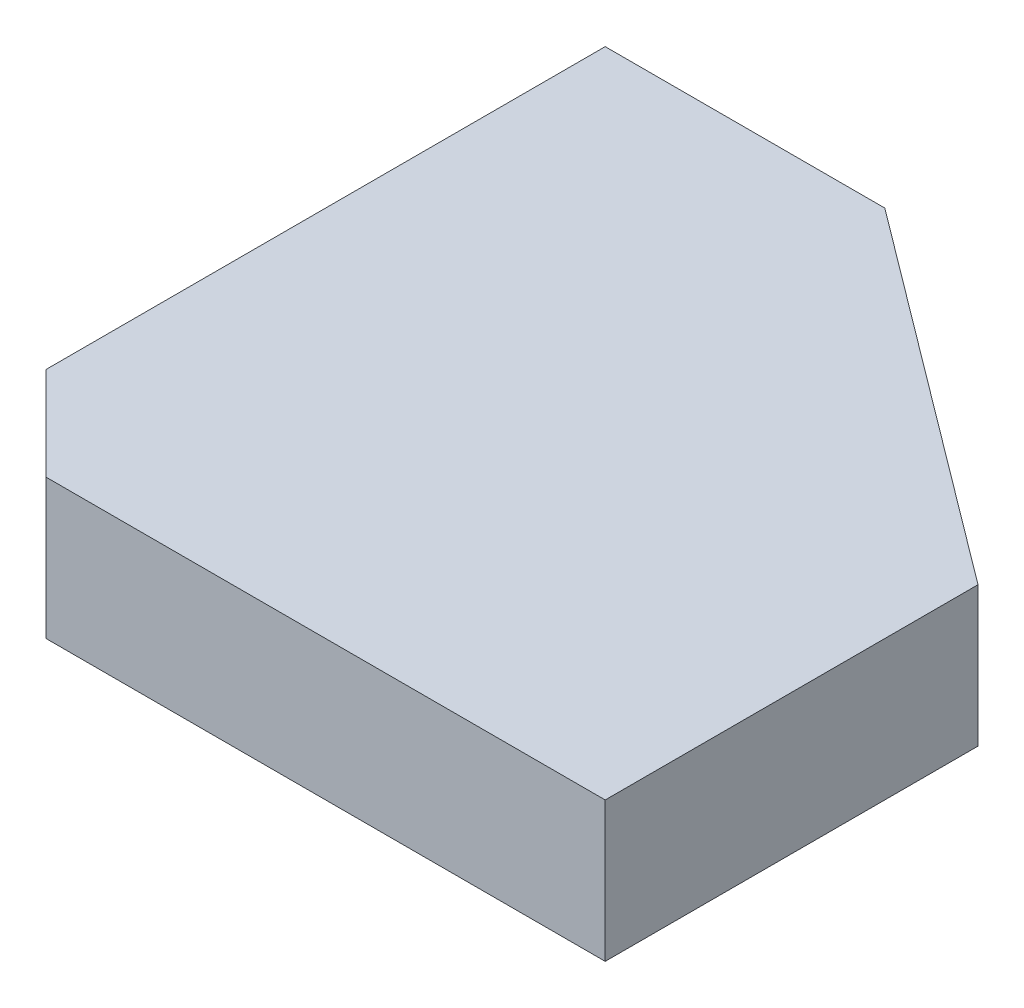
from build123d import *

# Parameters (mm, degrees)
BASE_EXTRUDE_DEPTH = 4.7625
CHAMFER1_SIZE      = 6.35


with BuildPart() as part:
    # Sketch1 → Base-Extrude (new, symmetric)
    with BuildSketch(Plane(origin=(0, 0, 0), x_dir=(1, 0, 0), z_dir=(0, 1, 0))):
        Polygon((0, 0), (44.45, 0), (44.45, 25.4), (19.05, 44.45), (0, 44.45), align=None)
    extrude(amount=BASE_EXTRUDE_DEPTH, both=True)

    # Chamfer1
    chamfer1_edges = [part.edges().sort_by_distance(p)[0] for p in [
        (0, 0, 0),
    ]]
    chamfer(chamfer1_edges, length=CHAMFER1_SIZE)


solid = part.part
